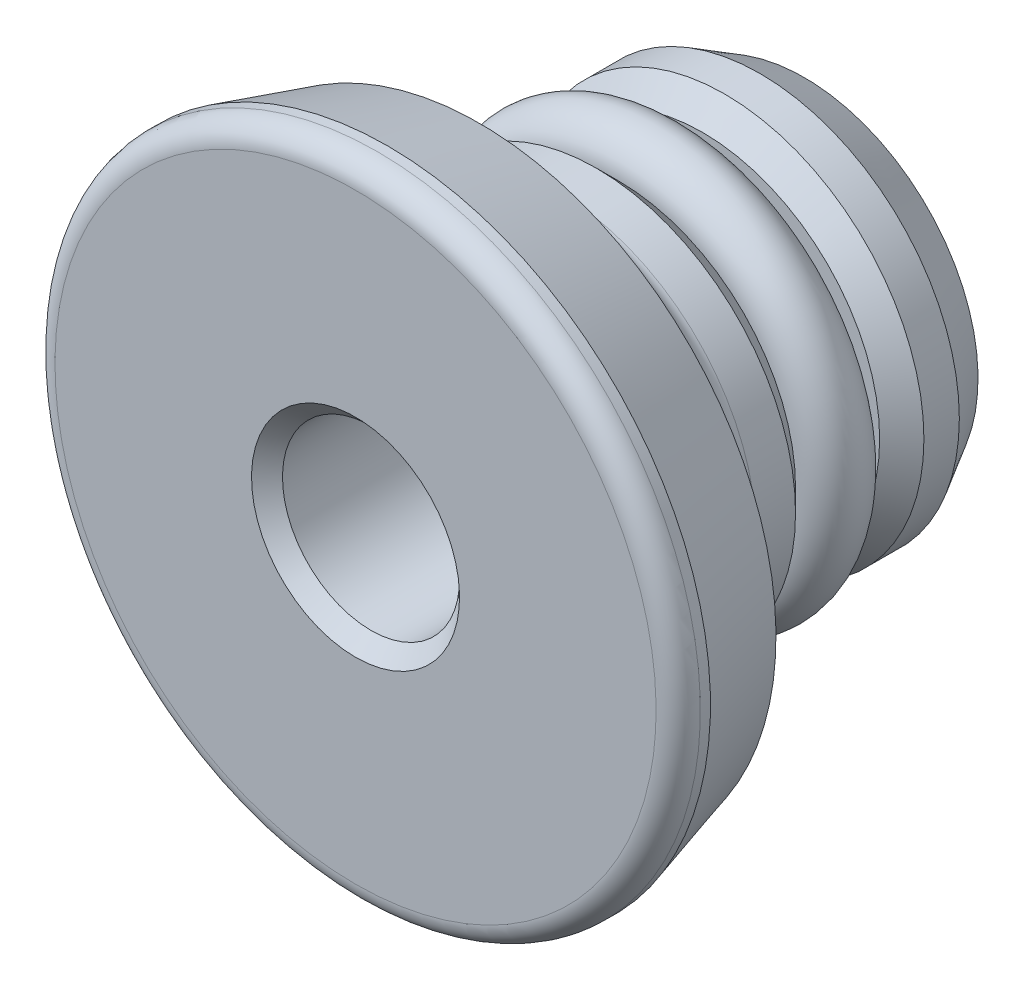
ISO-10303-21;
HEADER;
FILE_DESCRIPTION(('STEP AP214'),'2;1');
FILE_NAME('part.step','',(''),(''),'','','');
FILE_SCHEMA(('AUTOMOTIVE_DESIGN { 1 0 10303 214 1 1 1 1 }'));
ENDSEC;
DATA;
#1=APPLICATION_CONTEXT('core data for automotive mechanical design processes');
#2=APPLICATION_PROTOCOL_DEFINITION('international standard','automotive_design',2000,#1);
#3=PRODUCT_CONTEXT('',#1,'mechanical');
#4=PRODUCT('Part','Part','',(#3));
#5=PRODUCT_RELATED_PRODUCT_CATEGORY('part','',(#4));
#6=PRODUCT_DEFINITION_FORMATION('','',#4);
#7=PRODUCT_DEFINITION_CONTEXT('part definition',#1,'design');
#8=PRODUCT_DEFINITION('design','',#6,#7);
#9=PRODUCT_DEFINITION_SHAPE('','',#8);
#10=(LENGTH_UNIT() NAMED_UNIT(*) SI_UNIT(.MILLI.,.METRE.));
#11=(NAMED_UNIT(*) PLANE_ANGLE_UNIT() SI_UNIT($,.RADIAN.));
#12=(NAMED_UNIT(*) SI_UNIT($,.STERADIAN.) SOLID_ANGLE_UNIT());
#13=UNCERTAINTY_MEASURE_WITH_UNIT(LENGTH_MEASURE(1.E-05),#10,'distance_accuracy_value','');
#14=(GEOMETRIC_REPRESENTATION_CONTEXT(3) GLOBAL_UNCERTAINTY_ASSIGNED_CONTEXT((#13)) GLOBAL_UNIT_ASSIGNED_CONTEXT((#10,
#11,#12)) REPRESENTATION_CONTEXT('',''));
#15=CARTESIAN_POINT('',(0.,0.,0.));
#16=DIRECTION('',(0.,0.,1.));
#17=DIRECTION('',(1.,0.,0.));
#18=AXIS2_PLACEMENT_3D('',#15,#16,#17);
#19=CARTESIAN_POINT('',(0.,0.,0.96));
#20=DIRECTION('',(0.,0.,1.));
#21=DIRECTION('',(0.,-1.,0.));
#22=AXIS2_PLACEMENT_3D('',#19,#20,#21);
#23=CYLINDRICAL_SURFACE('',#22,7.29);
#24=CARTESIAN_POINT('',(0.,0.,-0.5));
#25=DIRECTION('',(0.,0.,1.));
#26=DIRECTION('',(0.,-1.,0.));
#27=AXIS2_PLACEMENT_3D('',#24,#25,#26);
#28=CIRCLE('',#27,7.29);
#29=CARTESIAN_POINT('',(0.,-7.29,-0.5));
#30=VERTEX_POINT('',#29);
#31=EDGE_CURVE('E45',#30,#30,#28,.F.);
#32=ORIENTED_EDGE('',*,*,#31,.T.);
#33=EDGE_LOOP('',(#32));
#34=FACE_BOUND('',#33,.T.);
#35=CARTESIAN_POINT('',(0.,0.,-0.7279810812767));
#36=DIRECTION('',(0.,0.,1.));
#37=DIRECTION('',(0.,-1.,0.));
#38=AXIS2_PLACEMENT_3D('',#35,#36,#37);
#39=CIRCLE('',#38,7.29);
#40=CARTESIAN_POINT('',(0.,-7.29,-0.7279810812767));
#41=VERTEX_POINT('',#40);
#42=EDGE_CURVE('E41',#41,#41,#39,.T.);
#43=ORIENTED_EDGE('',*,*,#42,.T.);
#44=EDGE_LOOP('',(#43));
#45=FACE_BOUND('',#44,.T.);
#46=ADVANCED_FACE('F12',(#34,#45),#23,.T.);
#47=CARTESIAN_POINT('',(0.,0.,0.96));
#48=DIRECTION('',(0.,0.,1.));
#49=DIRECTION('',(0.,-1.,0.));
#50=AXIS2_PLACEMENT_3D('',#47,#48,#49);
#51=CYLINDRICAL_SURFACE('',#50,4.5);
#52=CARTESIAN_POINT('',(0.,0.,-5.44));
#53=DIRECTION('',(0.,0.,-1.));
#54=DIRECTION('',(0.,1.,0.));
#55=AXIS2_PLACEMENT_3D('',#52,#53,#54);
#56=CIRCLE('',#55,4.5);
#57=CARTESIAN_POINT('',(0.,4.5,-5.44));
#58=VERTEX_POINT('',#57);
#59=EDGE_CURVE('E44',#58,#58,#56,.F.);
#60=ORIENTED_EDGE('',*,*,#59,.T.);
#61=EDGE_LOOP('',(#60));
#62=FACE_BOUND('',#61,.T.);
#63=CARTESIAN_POINT('',(0.,0.,-4.5482268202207));
#64=DIRECTION('',(0.,0.,1.));
#65=DIRECTION('',(0.,-1.,0.));
#66=AXIS2_PLACEMENT_3D('',#63,#64,#65);
#67=CIRCLE('',#66,4.5);
#68=CARTESIAN_POINT('',(0.,-4.5,-4.5482268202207));
#69=VERTEX_POINT('',#68);
#70=EDGE_CURVE('E40',#69,#69,#67,.F.);
#71=ORIENTED_EDGE('',*,*,#70,.T.);
#72=EDGE_LOOP('',(#71));
#73=FACE_BOUND('',#72,.T.);
#74=ADVANCED_FACE('F100',(#62,#73),#51,.T.);
#75=CARTESIAN_POINT('',(0.,0.,-2.80305746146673));
#76=DIRECTION('',(0.,0.,1.));
#77=DIRECTION('',(0.,-1.,0.));
#78=AXIS2_PLACEMENT_3D('',#75,#76,#77);
#79=CONICAL_SURFACE('',#78,6.69498142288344,0.279252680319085);
#80=ORIENTED_EDGE('',*,*,#42,.F.);
#81=EDGE_LOOP('',(#80));
#82=FACE_BOUND('',#81,.T.);
#83=CARTESIAN_POINT('',(0.,0.,-2.80305746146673));
#84=DIRECTION('',(0.,0.,1.));
#85=DIRECTION('',(0.,-1.,0.));
#86=AXIS2_PLACEMENT_3D('',#83,#84,#85);
#87=CIRCLE('',#86,6.69498142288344);
#88=CARTESIAN_POINT('',(0.,-6.69498142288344,-2.80305746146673));
#89=VERTEX_POINT('',#88);
#90=EDGE_CURVE('E36',#89,#89,#87,.T.);
#91=ORIENTED_EDGE('',*,*,#90,.T.);
#92=EDGE_LOOP('',(#91));
#93=FACE_BOUND('',#92,.T.);
#94=ADVANCED_FACE('F107',(#82,#93),#79,.T.);
#95=CARTESIAN_POINT('',(0.,0.,-4.34));
#96=DIRECTION('',(0.,0.,1.));
#97=DIRECTION('',(0.,-1.,0.));
#98=AXIS2_PLACEMENT_3D('',#95,#96,#97);
#99=CONICAL_SURFACE('',#98,4.5,0.959931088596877);
#100=CARTESIAN_POINT('',(0.,0.,-4.2205660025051));
#101=DIRECTION('',(0.,0.,1.));
#102=DIRECTION('',(0.,-1.,0.));
#103=AXIS2_PLACEMENT_3D('',#100,#101,#102);
#104=CIRCLE('',#103,4.67056942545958);
#105=CARTESIAN_POINT('',(0.,-4.67056942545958,-4.2205660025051));
#106=VERTEX_POINT('',#105);
#107=EDGE_CURVE('E39',#106,#106,#104,.T.);
#108=ORIENTED_EDGE('',*,*,#107,.T.);
#109=EDGE_LOOP('',(#108));
#110=FACE_BOUND('',#109,.T.);
#111=ORIENTED_EDGE('',*,*,#90,.F.);
#112=EDGE_LOOP('',(#111));
#113=FACE_BOUND('',#112,.T.);
#114=ADVANCED_FACE('F118',(#110,#113),#99,.T.);
#115=CARTESIAN_POINT('',(7.29,0.,0.));
#116=DIRECTION('',(0.,0.,1.));
#117=DIRECTION('',(0.,-1.,0.));
#118=AXIS2_PLACEMENT_3D('',#115,#116,#117);
#119=PLANE('',#118);
#120=CARTESIAN_POINT('',(0.,0.,0.));
#121=DIRECTION('',(0.,0.,1.));
#122=DIRECTION('',(0.,-1.,0.));
#123=AXIS2_PLACEMENT_3D('',#120,#121,#122);
#124=CIRCLE('',#123,6.79);
#125=CARTESIAN_POINT('',(0.,-6.79,0.));
#126=VERTEX_POINT('',#125);
#127=EDGE_CURVE('E49',#126,#126,#124,.T.);
#128=ORIENTED_EDGE('',*,*,#127,.T.);
#129=EDGE_LOOP('',(#128));
#130=FACE_BOUND('',#129,.T.);
#131=CARTESIAN_POINT('',(0.,0.,0.));
#132=DIRECTION('',(0.,0.,1.));
#133=DIRECTION('',(0.,-1.,0.));
#134=AXIS2_PLACEMENT_3D('',#131,#132,#133);
#135=CIRCLE('',#134,2.35);
#136=CARTESIAN_POINT('',(0.,-2.35,0.));
#137=VERTEX_POINT('',#136);
#138=EDGE_CURVE('E32',#137,#137,#135,.T.);
#139=ORIENTED_EDGE('',*,*,#138,.F.);
#140=EDGE_LOOP('',(#139));
#141=FACE_BOUND('',#140,.T.);
#142=ADVANCED_FACE('F121',(#130,#141),#119,.T.);
#143=CARTESIAN_POINT('',(0.,0.,0.));
#144=DIRECTION('',(0.,0.,1.));
#145=DIRECTION('',(0.,-1.,0.));
#146=AXIS2_PLACEMENT_3D('',#143,#144,#145);
#147=CONICAL_SURFACE('',#146,2.35,0.78539816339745);
#148=CARTESIAN_POINT('',(0.,0.,-0.35));
#149=DIRECTION('',(0.,0.,1.));
#150=DIRECTION('',(0.,-1.,0.));
#151=AXIS2_PLACEMENT_3D('',#148,#149,#150);
#152=CIRCLE('',#151,2.);
#153=CARTESIAN_POINT('',(0.,-2.,-0.35));
#154=VERTEX_POINT('',#153);
#155=EDGE_CURVE('E35',#154,#154,#152,.F.);
#156=ORIENTED_EDGE('',*,*,#155,.T.);
#157=EDGE_LOOP('',(#156));
#158=FACE_BOUND('',#157,.T.);
#159=ORIENTED_EDGE('',*,*,#138,.T.);
#160=EDGE_LOOP('',(#159));
#161=FACE_BOUND('',#160,.T.);
#162=ADVANCED_FACE('F78',(#158,#161),#147,.F.);
#163=CARTESIAN_POINT('',(0.,0.,-4.5482268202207));
#164=DIRECTION('',(0.,0.,1.));
#165=DIRECTION('',(0.,-1.,0.));
#166=AXIS2_PLACEMENT_3D('',#163,#164,#165);
#167=TOROIDAL_SURFACE('',#166,4.9,0.4);
#168=ORIENTED_EDGE('',*,*,#70,.F.);
#169=EDGE_LOOP('',(#168));
#170=FACE_BOUND('',#169,.T.);
#171=ORIENTED_EDGE('',*,*,#107,.F.);
#172=EDGE_LOOP('',(#171));
#173=FACE_BOUND('',#172,.T.);
#174=ADVANCED_FACE('F140',(#170,#173),#167,.F.);
#175=CARTESIAN_POINT('',(0.,0.,-0.5));
#176=DIRECTION('',(0.,0.,1.));
#177=DIRECTION('',(0.,-1.,0.));
#178=AXIS2_PLACEMENT_3D('',#175,#176,#177);
#179=TOROIDAL_SURFACE('',#178,6.79,0.5);
#180=ORIENTED_EDGE('',*,*,#31,.F.);
#181=EDGE_LOOP('',(#180));
#182=FACE_BOUND('',#181,.T.);
#183=ORIENTED_EDGE('',*,*,#127,.F.);
#184=EDGE_LOOP('',(#183));
#185=FACE_BOUND('',#184,.T.);
#186=ADVANCED_FACE('F145',(#182,#185),#179,.T.);
#187=CARTESIAN_POINT('',(0.,0.,-5.44));
#188=DIRECTION('',(0.,0.,1.));
#189=DIRECTION('',(0.,-1.,0.));
#190=AXIS2_PLACEMENT_3D('',#187,#188,#189);
#191=CONICAL_SURFACE('',#190,4.5,0.78539816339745);
#192=CARTESIAN_POINT('',(0.,0.,-5.94));
#193=DIRECTION('',(0.,0.,1.));
#194=DIRECTION('',(0.,-1.,0.));
#195=AXIS2_PLACEMENT_3D('',#192,#193,#194);
#196=CIRCLE('',#195,4.);
#197=CARTESIAN_POINT('',(0.,-4.,-5.94));
#198=VERTEX_POINT('',#197);
#199=EDGE_CURVE('E23',#198,#198,#196,.T.);
#200=ORIENTED_EDGE('',*,*,#199,.T.);
#201=EDGE_LOOP('',(#200));
#202=FACE_BOUND('',#201,.T.);
#203=ORIENTED_EDGE('',*,*,#59,.F.);
#204=EDGE_LOOP('',(#203));
#205=FACE_BOUND('',#204,.T.);
#206=ADVANCED_FACE('F94',(#202,#205),#191,.T.);
#207=CARTESIAN_POINT('',(0.,0.,-3.65));
#208=DIRECTION('',(0.,0.,1.));
#209=DIRECTION('',(0.,-1.,0.));
#210=AXIS2_PLACEMENT_3D('',#207,#208,#209);
#211=PLANE('',#210);
#212=CARTESIAN_POINT('',(0.,0.,-3.65));
#213=DIRECTION('',(0.,0.,1.));
#214=DIRECTION('',(0.,-1.,0.));
#215=AXIS2_PLACEMENT_3D('',#212,#213,#214);
#216=CIRCLE('',#215,2.);
#217=CARTESIAN_POINT('',(0.,-2.,-3.65));
#218=VERTEX_POINT('',#217);
#219=EDGE_CURVE('E27',#218,#218,#216,.T.);
#220=ORIENTED_EDGE('',*,*,#219,.T.);
#221=EDGE_LOOP('',(#220));
#222=FACE_BOUND('',#221,.T.);
#223=ADVANCED_FACE('F84',(#222),#211,.T.);
#224=CARTESIAN_POINT('',(0.,0.,-3.65));
#225=DIRECTION('',(0.,0.,1.));
#226=DIRECTION('',(0.,-1.,0.));
#227=AXIS2_PLACEMENT_3D('',#224,#225,#226);
#228=CYLINDRICAL_SURFACE('',#227,2.);
#229=ORIENTED_EDGE('',*,*,#219,.F.);
#230=EDGE_LOOP('',(#229));
#231=FACE_BOUND('',#230,.T.);
#232=ORIENTED_EDGE('',*,*,#155,.F.);
#233=EDGE_LOOP('',(#232));
#234=FACE_BOUND('',#233,.T.);
#235=ADVANCED_FACE('F81',(#231,#234),#228,.F.);
#236=CARTESIAN_POINT('',(0.,-4.,-6.72170470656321));
#237=DIRECTION('',(0.,0.,-1.));
#238=DIRECTION('',(0.,1.,0.));
#239=AXIS2_PLACEMENT_3D('',#236,#237,#238);
#240=PLANE('',#239);
#241=CARTESIAN_POINT('',(0.,0.,-6.72170470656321));
#242=DIRECTION('',(0.,0.,-1.));
#243=DIRECTION('',(0.,1.,0.));
#244=AXIS2_PLACEMENT_3D('',#241,#242,#243);
#245=CIRCLE('',#244,3.2);
#246=CARTESIAN_POINT('',(0.,3.2,-6.72170470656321));
#247=VERTEX_POINT('',#246);
#248=EDGE_CURVE('E8',#247,#247,#245,.T.);
#249=ORIENTED_EDGE('',*,*,#248,.F.);
#250=EDGE_LOOP('',(#249));
#251=FACE_BOUND('',#250,.T.);
#252=CARTESIAN_POINT('',(0.,0.,-6.72170470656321));
#253=DIRECTION('',(0.,0.,1.));
#254=DIRECTION('',(0.,-1.,0.));
#255=AXIS2_PLACEMENT_3D('',#252,#253,#254);
#256=CIRCLE('',#255,3.25067042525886);
#257=CARTESIAN_POINT('',(0.,-3.25067042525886,-6.72170470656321));
#258=VERTEX_POINT('',#257);
#259=EDGE_CURVE('E19',#258,#258,#256,.F.);
#260=ORIENTED_EDGE('',*,*,#259,.T.);
#261=EDGE_LOOP('',(#260));
#262=FACE_BOUND('',#261,.T.);
#263=ADVANCED_FACE('F83',(#251,#262),#240,.T.);
#264=CARTESIAN_POINT('',(0.,0.,-6.69));
#265=DIRECTION('',(0.,0.,1.));
#266=DIRECTION('',(-1.,0.,0.));
#267=AXIS2_PLACEMENT_3D('',#264,#265,#266);
#268=TOROIDAL_SURFACE('',#267,4.,0.75);
#269=ORIENTED_EDGE('',*,*,#259,.F.);
#270=EDGE_LOOP('',(#269));
#271=FACE_BOUND('',#270,.T.);
#272=ORIENTED_EDGE('',*,*,#199,.F.);
#273=EDGE_LOOP('',(#272));
#274=FACE_BOUND('',#273,.T.);
#275=ADVANCED_FACE('F14',(#271,#274),#268,.T.);
#276=CARTESIAN_POINT('',(4.5,0.,-10.14));
#277=DIRECTION('',(0.,0.,1.));
#278=DIRECTION('',(0.,-1.,0.));
#279=AXIS2_PLACEMENT_3D('',#276,#277,#278);
#280=PLANE('',#279);
#281=CARTESIAN_POINT('',(0.,0.,-10.14));
#282=DIRECTION('',(0.,0.,1.));
#283=DIRECTION('',(0.,-1.,0.));
#284=AXIS2_PLACEMENT_3D('',#281,#282,#283);
#285=CIRCLE('',#284,3.92264973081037);
#286=CARTESIAN_POINT('',(0.,-3.92264973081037,-10.14));
#287=VERTEX_POINT('',#286);
#288=EDGE_CURVE('E51',#287,#287,#285,.F.);
#289=ORIENTED_EDGE('',*,*,#288,.T.);
#290=EDGE_LOOP('',(#289));
#291=FACE_BOUND('',#290,.T.);
#292=ADVANCED_FACE('F124',(#291),#280,.F.);
#293=CARTESIAN_POINT('',(0.,0.,-9.14));
#294=DIRECTION('',(0.,0.,1.));
#295=DIRECTION('',(0.,-1.,0.));
#296=AXIS2_PLACEMENT_3D('',#293,#294,#295);
#297=CONICAL_SURFACE('',#296,4.5,0.523598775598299);
#298=ORIENTED_EDGE('',*,*,#288,.F.);
#299=EDGE_LOOP('',(#298));
#300=FACE_BOUND('',#299,.T.);
#301=CARTESIAN_POINT('',(0.,0.,-9.14));
#302=DIRECTION('',(0.,0.,1.));
#303=DIRECTION('',(0.,-1.,0.));
#304=AXIS2_PLACEMENT_3D('',#301,#302,#303);
#305=CIRCLE('',#304,4.5);
#306=CARTESIAN_POINT('',(0.,-4.5,-9.14));
#307=VERTEX_POINT('',#306);
#308=EDGE_CURVE('E46',#307,#307,#305,.T.);
#309=ORIENTED_EDGE('',*,*,#308,.F.);
#310=EDGE_LOOP('',(#309));
#311=FACE_BOUND('',#310,.T.);
#312=ADVANCED_FACE('F114',(#300,#311),#297,.T.);
#313=CARTESIAN_POINT('',(0.,0.,-8.34));
#314=DIRECTION('',(0.,0.,1.));
#315=DIRECTION('',(0.,-1.,0.));
#316=AXIS2_PLACEMENT_3D('',#313,#314,#315);
#317=CIRCLE('',#316,4.5);
#318=CARTESIAN_POINT('',(0.,-4.5,-8.34));
#319=VERTEX_POINT('',#318);
#320=EDGE_CURVE('E50',#319,#319,#317,.F.);
#321=ORIENTED_EDGE('',*,*,#320,.T.);
#322=EDGE_LOOP('',(#321));
#323=FACE_BOUND('',#322,.T.);
#324=ORIENTED_EDGE('',*,*,#308,.T.);
#325=EDGE_LOOP('',(#324));
#326=FACE_BOUND('',#325,.T.);
#327=ADVANCED_FACE('F110',(#323,#326),#51,.T.);
#328=CARTESIAN_POINT('',(0.,0.,-7.84));
#329=DIRECTION('',(0.,0.,-1.));
#330=DIRECTION('',(0.,1.,0.));
#331=AXIS2_PLACEMENT_3D('',#328,#329,#330);
#332=CONICAL_SURFACE('',#331,4.,0.785398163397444);
#333=ORIENTED_EDGE('',*,*,#320,.F.);
#334=EDGE_LOOP('',(#333));
#335=FACE_BOUND('',#334,.T.);
#336=CARTESIAN_POINT('',(0.,0.,-7.84));
#337=DIRECTION('',(0.,0.,1.));
#338=DIRECTION('',(0.,-1.,0.));
#339=AXIS2_PLACEMENT_3D('',#336,#337,#338);
#340=CIRCLE('',#339,4.);
#341=CARTESIAN_POINT('',(0.,-4.,-7.84));
#342=VERTEX_POINT('',#341);
#343=EDGE_CURVE('E57',#342,#342,#340,.T.);
#344=ORIENTED_EDGE('',*,*,#343,.F.);
#345=EDGE_LOOP('',(#344));
#346=FACE_BOUND('',#345,.T.);
#347=ADVANCED_FACE('F132',(#335,#346),#332,.T.);
#348=CARTESIAN_POINT('',(4.5,0.,-7.84));
#349=DIRECTION('',(0.,0.,1.));
#350=DIRECTION('',(0.,-1.,0.));
#351=AXIS2_PLACEMENT_3D('',#348,#349,#350);
#352=PLANE('',#351);
#353=ORIENTED_EDGE('',*,*,#343,.T.);
#354=EDGE_LOOP('',(#353));
#355=FACE_BOUND('',#354,.T.);
#356=CARTESIAN_POINT('',(0.,0.,-7.84));
#357=DIRECTION('',(0.,0.,1.));
#358=DIRECTION('',(0.,-1.,0.));
#359=AXIS2_PLACEMENT_3D('',#356,#357,#358);
#360=CIRCLE('',#359,3.6);
#361=CARTESIAN_POINT('',(0.,-3.6,-7.84));
#362=VERTEX_POINT('',#361);
#363=EDGE_CURVE('E66',#362,#362,#360,.F.);
#364=ORIENTED_EDGE('',*,*,#363,.T.);
#365=EDGE_LOOP('',(#364));
#366=FACE_BOUND('',#365,.T.);
#367=ADVANCED_FACE('F128',(#355,#366),#352,.T.);
#368=CARTESIAN_POINT('',(0.,0.,-7.44));
#369=DIRECTION('',(0.,0.,1.));
#370=DIRECTION('',(0.,-1.,0.));
#371=AXIS2_PLACEMENT_3D('',#368,#369,#370);
#372=TOROIDAL_SURFACE('',#371,3.6,0.4);
#373=ORIENTED_EDGE('',*,*,#363,.F.);
#374=EDGE_LOOP('',(#373));
#375=FACE_BOUND('',#374,.T.);
#376=CARTESIAN_POINT('',(0.,0.,-7.44));
#377=DIRECTION('',(0.,0.,1.));
#378=DIRECTION('',(0.,-1.,0.));
#379=AXIS2_PLACEMENT_3D('',#376,#377,#378);
#380=CIRCLE('',#379,3.2);
#381=CARTESIAN_POINT('',(0.,-3.2,-7.44));
#382=VERTEX_POINT('',#381);
#383=EDGE_CURVE('E54',#382,#382,#380,.T.);
#384=ORIENTED_EDGE('',*,*,#383,.F.);
#385=EDGE_LOOP('',(#384));
#386=FACE_BOUND('',#385,.T.);
#387=ADVANCED_FACE('F131',(#375,#386),#372,.F.);
#388=CARTESIAN_POINT('',(0.,0.,0.96));
#389=DIRECTION('',(0.,0.,1.));
#390=DIRECTION('',(0.,-1.,0.));
#391=AXIS2_PLACEMENT_3D('',#388,#389,#390);
#392=CYLINDRICAL_SURFACE('',#391,3.2);
#393=ORIENTED_EDGE('',*,*,#248,.T.);
#394=EDGE_LOOP('',(#393));
#395=FACE_BOUND('',#394,.T.);
#396=ORIENTED_EDGE('',*,*,#383,.T.);
#397=EDGE_LOOP('',(#396));
#398=FACE_BOUND('',#397,.T.);
#399=ADVANCED_FACE('F134',(#395,#398),#392,.T.);
#400=CLOSED_SHELL('',(#46,#74,#94,#114,#142,#162,#174,#186,#206,#223,#235,#263,#275,#292,#312,
#327,#347,#367,#387,#399));
#401=MANIFOLD_SOLID_BREP('B1',#400);
#402=ADVANCED_BREP_SHAPE_REPRESENTATION('',(#18,#401),#14);
#403=SHAPE_DEFINITION_REPRESENTATION(#9,#402);
ENDSEC;
END-ISO-10303-21;
